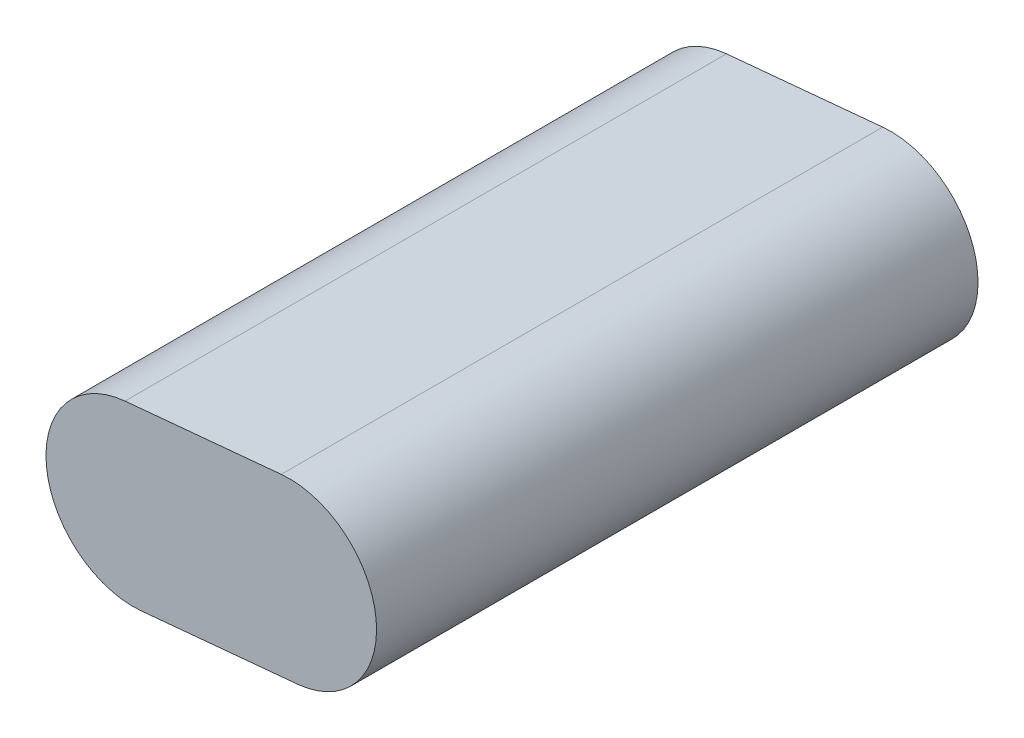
ISO-10303-21;
HEADER;
FILE_DESCRIPTION(('STEP AP214'),'2;1');
FILE_NAME('part.step','',(''),(''),'','','');
FILE_SCHEMA(('AUTOMOTIVE_DESIGN { 1 0 10303 214 1 1 1 1 }'));
ENDSEC;
DATA;
#1=APPLICATION_CONTEXT('core data for automotive mechanical design processes');
#2=APPLICATION_PROTOCOL_DEFINITION('international standard','automotive_design',2000,#1);
#3=PRODUCT_CONTEXT('',#1,'mechanical');
#4=PRODUCT('Part','Part','',(#3));
#5=PRODUCT_RELATED_PRODUCT_CATEGORY('part','',(#4));
#6=PRODUCT_DEFINITION_FORMATION('','',#4);
#7=PRODUCT_DEFINITION_CONTEXT('part definition',#1,'design');
#8=PRODUCT_DEFINITION('design','',#6,#7);
#9=PRODUCT_DEFINITION_SHAPE('','',#8);
#10=(LENGTH_UNIT() NAMED_UNIT(*) SI_UNIT(.MILLI.,.METRE.));
#11=(NAMED_UNIT(*) PLANE_ANGLE_UNIT() SI_UNIT($,.RADIAN.));
#12=(NAMED_UNIT(*) SI_UNIT($,.STERADIAN.) SOLID_ANGLE_UNIT());
#13=UNCERTAINTY_MEASURE_WITH_UNIT(LENGTH_MEASURE(1.E-05),#10,'distance_accuracy_value','');
#14=(GEOMETRIC_REPRESENTATION_CONTEXT(3) GLOBAL_UNCERTAINTY_ASSIGNED_CONTEXT((#13)) GLOBAL_UNIT_ASSIGNED_CONTEXT((#10,
#11,#12)) REPRESENTATION_CONTEXT('',''));
#15=CARTESIAN_POINT('',(0.,0.,0.));
#16=DIRECTION('',(0.,0.,1.));
#17=DIRECTION('',(1.,0.,0.));
#18=AXIS2_PLACEMENT_3D('',#15,#16,#17);
#19=CARTESIAN_POINT('',(0.933851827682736,-9.95630055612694,-108.68170064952));
#20=DIRECTION('',(0.0933851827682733,-0.995630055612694,0.));
#21=DIRECTION('',(0.995630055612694,0.0933851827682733,0.));
#22=AXIS2_PLACEMENT_3D('',#19,#20,#21);
#23=PLANE('',#22);
#24=DIRECTION('',(0.,0.,1.));
#25=VECTOR('',#24,1.);
#26=CARTESIAN_POINT('',(0.933851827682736,-9.95630055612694,-108.68170064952));
#27=LINE('',#26,#25);
#28=CARTESIAN_POINT('',(0.93385182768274,-9.95630055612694,-67.));
#29=VERTEX_POINT('',#28);
#30=CARTESIAN_POINT('',(0.933851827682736,-9.95630055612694,2.));
#31=VERTEX_POINT('',#30);
#32=EDGE_CURVE('E117',#29,#31,#27,.T.);
#33=ORIENTED_EDGE('',*,*,#32,.F.);
#34=DIRECTION('',(-0.995630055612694,-0.0933851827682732,0.));
#35=VECTOR('',#34,1.);
#36=CARTESIAN_POINT('',(18.8551928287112,-8.27536726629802,-67.));
#37=LINE('',#36,#35);
#38=CARTESIAN_POINT('',(18.8551928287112,-8.27536726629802,-67.));
#39=VERTEX_POINT('',#38);
#40=EDGE_CURVE('E146',#39,#29,#37,.T.);
#41=ORIENTED_EDGE('',*,*,#40,.F.);
#42=DIRECTION('',(0.,0.,1.));
#43=VECTOR('',#42,1.);
#44=CARTESIAN_POINT('',(18.8551928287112,-8.27536726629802,-108.68170064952));
#45=LINE('',#44,#43);
#46=CARTESIAN_POINT('',(18.8551928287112,-8.27536726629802,2.));
#47=VERTEX_POINT('',#46);
#48=EDGE_CURVE('E126',#39,#47,#45,.T.);
#49=ORIENTED_EDGE('',*,*,#48,.T.);
#50=DIRECTION('',(0.995630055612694,0.0933851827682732,0.));
#51=VECTOR('',#50,1.);
#52=CARTESIAN_POINT('',(0.933851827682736,-9.95630055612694,2.));
#53=LINE('',#52,#51);
#54=EDGE_CURVE('E129',#31,#47,#53,.T.);
#55=ORIENTED_EDGE('',*,*,#54,.F.);
#56=EDGE_LOOP('',(#33,#41,#49,#55));
#57=FACE_BOUND('',#56,.T.);
#58=ADVANCED_FACE('F50',(#57),#23,.T.);
#59=CARTESIAN_POINT('',(17.9213410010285,1.68093328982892,-108.68170064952));
#60=DIRECTION('',(0.,0.,1.));
#61=DIRECTION('',(1.,0.,0.));
#62=AXIS2_PLACEMENT_3D('',#59,#60,#61);
#63=CYLINDRICAL_SURFACE('',#62,10.);
#64=ORIENTED_EDGE('',*,*,#48,.F.);
#65=CARTESIAN_POINT('',(17.9213410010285,1.68093328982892,-67.));
#66=DIRECTION('',(0.,0.,-1.));
#67=DIRECTION('',(-1.,0.,0.));
#68=AXIS2_PLACEMENT_3D('',#65,#66,#67);
#69=CIRCLE('',#68,10.);
#70=CARTESIAN_POINT('',(16.9874891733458,11.6372338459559,-67.));
#71=VERTEX_POINT('',#70);
#72=EDGE_CURVE('E143',#71,#39,#69,.T.);
#73=ORIENTED_EDGE('',*,*,#72,.F.);
#74=DIRECTION('',(0.,0.,1.));
#75=VECTOR('',#74,1.);
#76=CARTESIAN_POINT('',(16.9874891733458,11.6372338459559,-108.68170064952));
#77=LINE('',#76,#75);
#78=CARTESIAN_POINT('',(16.9874891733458,11.6372338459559,2.));
#79=VERTEX_POINT('',#78);
#80=EDGE_CURVE('E178',#71,#79,#77,.T.);
#81=ORIENTED_EDGE('',*,*,#80,.T.);
#82=CARTESIAN_POINT('',(17.9213410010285,1.68093328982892,2.));
#83=DIRECTION('',(0.,0.,1.));
#84=DIRECTION('',(1.,0.,0.));
#85=AXIS2_PLACEMENT_3D('',#82,#83,#84);
#86=CIRCLE('',#85,10.);
#87=EDGE_CURVE('E133',#47,#79,#86,.T.);
#88=ORIENTED_EDGE('',*,*,#87,.F.);
#89=EDGE_LOOP('',(#64,#73,#81,#88));
#90=FACE_BOUND('',#89,.T.);
#91=ADVANCED_FACE('F182',(#90),#63,.T.);
#92=CARTESIAN_POINT('',(-0.933851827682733,9.95630055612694,-108.68170064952));
#93=DIRECTION('',(-0.0933851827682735,0.995630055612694,0.));
#94=DIRECTION('',(-0.995630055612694,-0.0933851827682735,0.));
#95=AXIS2_PLACEMENT_3D('',#92,#93,#94);
#96=PLANE('',#95);
#97=ORIENTED_EDGE('',*,*,#80,.F.);
#98=DIRECTION('',(0.995630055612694,0.0933851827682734,0.));
#99=VECTOR('',#98,1.);
#100=CARTESIAN_POINT('',(-0.933851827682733,9.95630055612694,-67.));
#101=LINE('',#100,#99);
#102=CARTESIAN_POINT('',(-0.933851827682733,9.95630055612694,-67.));
#103=VERTEX_POINT('',#102);
#104=EDGE_CURVE('E149',#103,#71,#101,.T.);
#105=ORIENTED_EDGE('',*,*,#104,.F.);
#106=DIRECTION('',(0.,0.,1.));
#107=VECTOR('',#106,1.);
#108=CARTESIAN_POINT('',(-0.933851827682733,9.95630055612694,-108.68170064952));
#109=LINE('',#108,#107);
#110=CARTESIAN_POINT('',(-0.933851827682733,9.95630055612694,2.));
#111=VERTEX_POINT('',#110);
#112=EDGE_CURVE('E176',#103,#111,#109,.T.);
#113=ORIENTED_EDGE('',*,*,#112,.T.);
#114=DIRECTION('',(-0.995630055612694,-0.0933851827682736,0.));
#115=VECTOR('',#114,1.);
#116=CARTESIAN_POINT('',(16.9874891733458,11.6372338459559,2.));
#117=LINE('',#116,#115);
#118=EDGE_CURVE('E138',#79,#111,#117,.T.);
#119=ORIENTED_EDGE('',*,*,#118,.F.);
#120=EDGE_LOOP('',(#97,#105,#113,#119));
#121=FACE_BOUND('',#120,.T.);
#122=ADVANCED_FACE('F185',(#121),#96,.T.);
#123=CARTESIAN_POINT('',(0.,0.,-108.68170064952));
#124=DIRECTION('',(0.,0.,1.));
#125=DIRECTION('',(1.,0.,0.));
#126=AXIS2_PLACEMENT_3D('',#123,#124,#125);
#127=CYLINDRICAL_SURFACE('',#126,10.);
#128=ORIENTED_EDGE('',*,*,#112,.F.);
#129=CARTESIAN_POINT('',(0.,0.,-67.));
#130=DIRECTION('',(0.,0.,-1.));
#131=DIRECTION('',(-1.,0.,0.));
#132=AXIS2_PLACEMENT_3D('',#129,#130,#131);
#133=CIRCLE('',#132,10.);
#134=EDGE_CURVE('E122',#29,#103,#133,.T.);
#135=ORIENTED_EDGE('',*,*,#134,.F.);
#136=ORIENTED_EDGE('',*,*,#32,.T.);
#137=CARTESIAN_POINT('',(0.,0.,2.));
#138=DIRECTION('',(0.,0.,1.));
#139=DIRECTION('',(1.,0.,0.));
#140=AXIS2_PLACEMENT_3D('',#137,#138,#139);
#141=CIRCLE('',#140,10.);
#142=EDGE_CURVE('E120',#111,#31,#141,.T.);
#143=ORIENTED_EDGE('',*,*,#142,.F.);
#144=EDGE_LOOP('',(#128,#135,#136,#143));
#145=FACE_BOUND('',#144,.T.);
#146=ADVANCED_FACE('F52',(#145),#127,.T.);
#147=CARTESIAN_POINT('',(17.9213410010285,1.68093328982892,-67.));
#148=DIRECTION('',(0.,0.,-1.));
#149=DIRECTION('',(-1.,0.,0.));
#150=AXIS2_PLACEMENT_3D('',#147,#148,#149);
#151=PLANE('',#150);
#152=ORIENTED_EDGE('',*,*,#72,.T.);
#153=ORIENTED_EDGE('',*,*,#40,.T.);
#154=ORIENTED_EDGE('',*,*,#134,.T.);
#155=ORIENTED_EDGE('',*,*,#104,.T.);
#156=EDGE_LOOP('',(#152,#153,#154,#155));
#157=FACE_BOUND('',#156,.T.);
#158=ADVANCED_FACE('F187',(#157),#151,.T.);
#159=CARTESIAN_POINT('',(0.,0.,2.));
#160=DIRECTION('',(0.,0.,1.));
#161=DIRECTION('',(1.,0.,0.));
#162=AXIS2_PLACEMENT_3D('',#159,#160,#161);
#163=PLANE('',#162);
#164=ORIENTED_EDGE('',*,*,#142,.T.);
#165=ORIENTED_EDGE('',*,*,#54,.T.);
#166=ORIENTED_EDGE('',*,*,#87,.T.);
#167=ORIENTED_EDGE('',*,*,#118,.T.);
#168=EDGE_LOOP('',(#164,#165,#166,#167));
#169=FACE_BOUND('',#168,.T.);
#170=ADVANCED_FACE('F136',(#169),#163,.T.);
#171=CLOSED_SHELL('',(#58,#91,#122,#146,#158,#170));
#172=CARTESIAN_POINT('',(17.9213410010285,1.68093328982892,-65.));
#173=DIRECTION('',(0.,0.,-1.));
#174=DIRECTION('',(-1.,0.,0.));
#175=AXIS2_PLACEMENT_3D('',#172,#173,#174);
#176=PLANE('',#175);
#177=DIRECTION('',(-0.995630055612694,-0.0933851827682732,0.));
#178=VECTOR('',#177,1.);
#179=CARTESIAN_POINT('',(0.84046664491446,-8.96067050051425,-65.));
#180=LINE('',#179,#178);
#181=CARTESIAN_POINT('',(18.761807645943,-7.27973721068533,-65.));
#182=VERTEX_POINT('',#181);
#183=CARTESIAN_POINT('',(0.84046664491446,-8.96067050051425,-65.));
#184=VERTEX_POINT('',#183);
#185=EDGE_CURVE('E54',#182,#184,#180,.T.);
#186=ORIENTED_EDGE('',*,*,#185,.F.);
#187=CARTESIAN_POINT('',(17.9213410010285,1.68093328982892,-65.));
#188=DIRECTION('',(0.,0.,1.));
#189=DIRECTION('',(1.,0.,0.));
#190=AXIS2_PLACEMENT_3D('',#187,#188,#189);
#191=CIRCLE('',#190,9.);
#192=CARTESIAN_POINT('',(17.080874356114,10.6416037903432,-65.));
#193=VERTEX_POINT('',#192);
#194=EDGE_CURVE('E13',#193,#182,#191,.F.);
#195=ORIENTED_EDGE('',*,*,#194,.F.);
#196=DIRECTION('',(0.995630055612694,0.0933851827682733,0.));
#197=VECTOR('',#196,1.);
#198=CARTESIAN_POINT('',(-0.84046664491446,8.96067050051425,-65.));
#199=LINE('',#198,#197);
#200=CARTESIAN_POINT('',(-0.84046664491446,8.96067050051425,-65.));
#201=VERTEX_POINT('',#200);
#202=EDGE_CURVE('E60',#201,#193,#199,.T.);
#203=ORIENTED_EDGE('',*,*,#202,.F.);
#204=CARTESIAN_POINT('',(0.,0.,-65.));
#205=DIRECTION('',(0.,0.,1.));
#206=DIRECTION('',(1.,0.,0.));
#207=AXIS2_PLACEMENT_3D('',#204,#205,#206);
#208=CIRCLE('',#207,9.);
#209=EDGE_CURVE('E154',#184,#201,#208,.F.);
#210=ORIENTED_EDGE('',*,*,#209,.F.);
#211=EDGE_LOOP('',(#186,#195,#203,#210));
#212=FACE_BOUND('',#211,.T.);
#213=ADVANCED_FACE('F216',(#212),#176,.F.);
#214=CARTESIAN_POINT('',(0.84046664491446,-8.96067050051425,-108.68170064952));
#215=DIRECTION('',(0.0933851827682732,-0.995630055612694,0.));
#216=DIRECTION('',(0.995630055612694,0.0933851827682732,0.));
#217=AXIS2_PLACEMENT_3D('',#214,#215,#216);
#218=PLANE('',#217);
#219=DIRECTION('',(0.,0.,1.));
#220=VECTOR('',#219,1.);
#221=CARTESIAN_POINT('',(18.761807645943,-7.27973721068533,-108.68170064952));
#222=LINE('',#221,#220);
#223=CARTESIAN_POINT('',(18.761807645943,-7.27973721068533,0.));
#224=VERTEX_POINT('',#223);
#225=EDGE_CURVE('E172',#182,#224,#222,.T.);
#226=ORIENTED_EDGE('',*,*,#225,.F.);
#227=ORIENTED_EDGE('',*,*,#185,.T.);
#228=DIRECTION('',(0.,0.,1.));
#229=VECTOR('',#228,1.);
#230=CARTESIAN_POINT('',(0.84046664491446,-8.96067050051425,-108.68170064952));
#231=LINE('',#230,#229);
#232=CARTESIAN_POINT('',(0.84046664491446,-8.96067050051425,0.));
#233=VERTEX_POINT('',#232);
#234=EDGE_CURVE('E166',#184,#233,#231,.T.);
#235=ORIENTED_EDGE('',*,*,#234,.T.);
#236=DIRECTION('',(0.995630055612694,0.0933851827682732,0.));
#237=VECTOR('',#236,1.);
#238=CARTESIAN_POINT('',(0.84046664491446,-8.96067050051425,0.));
#239=LINE('',#238,#237);
#240=EDGE_CURVE('E159',#233,#224,#239,.T.);
#241=ORIENTED_EDGE('',*,*,#240,.T.);
#242=EDGE_LOOP('',(#226,#227,#235,#241));
#243=FACE_BOUND('',#242,.T.);
#244=ADVANCED_FACE('F212',(#243),#218,.F.);
#245=CARTESIAN_POINT('',(17.9213410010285,1.68093328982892,-108.68170064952));
#246=DIRECTION('',(0.,0.,1.));
#247=DIRECTION('',(1.,0.,0.));
#248=AXIS2_PLACEMENT_3D('',#245,#246,#247);
#249=CYLINDRICAL_SURFACE('',#248,9.);
#250=DIRECTION('',(0.,0.,1.));
#251=VECTOR('',#250,1.);
#252=CARTESIAN_POINT('',(17.080874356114,10.6416037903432,-108.68170064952));
#253=LINE('',#252,#251);
#254=CARTESIAN_POINT('',(17.080874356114,10.6416037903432,0.));
#255=VERTEX_POINT('',#254);
#256=EDGE_CURVE('E169',#193,#255,#253,.T.);
#257=ORIENTED_EDGE('',*,*,#256,.F.);
#258=ORIENTED_EDGE('',*,*,#194,.T.);
#259=ORIENTED_EDGE('',*,*,#225,.T.);
#260=CARTESIAN_POINT('',(17.9213410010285,1.68093328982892,0.));
#261=DIRECTION('',(0.,0.,1.));
#262=DIRECTION('',(1.,0.,0.));
#263=AXIS2_PLACEMENT_3D('',#260,#261,#262);
#264=CIRCLE('',#263,9.);
#265=EDGE_CURVE('E75',#224,#255,#264,.T.);
#266=ORIENTED_EDGE('',*,*,#265,.T.);
#267=EDGE_LOOP('',(#257,#258,#259,#266));
#268=FACE_BOUND('',#267,.T.);
#269=ADVANCED_FACE('F215',(#268),#249,.F.);
#270=CARTESIAN_POINT('',(-0.84046664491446,8.96067050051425,-108.68170064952));
#271=DIRECTION('',(-0.0933851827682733,0.995630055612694,0.));
#272=DIRECTION('',(-0.995630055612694,-0.0933851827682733,0.));
#273=AXIS2_PLACEMENT_3D('',#270,#271,#272);
#274=PLANE('',#273);
#275=DIRECTION('',(0.,0.,1.));
#276=VECTOR('',#275,1.);
#277=CARTESIAN_POINT('',(-0.84046664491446,8.96067050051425,-108.68170064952));
#278=LINE('',#277,#276);
#279=CARTESIAN_POINT('',(-0.84046664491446,8.96067050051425,0.));
#280=VERTEX_POINT('',#279);
#281=EDGE_CURVE('E127',#201,#280,#278,.T.);
#282=ORIENTED_EDGE('',*,*,#281,.F.);
#283=ORIENTED_EDGE('',*,*,#202,.T.);
#284=ORIENTED_EDGE('',*,*,#256,.T.);
#285=DIRECTION('',(-0.995630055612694,-0.0933851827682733,0.));
#286=VECTOR('',#285,1.);
#287=CARTESIAN_POINT('',(-0.84046664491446,8.96067050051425,0.));
#288=LINE('',#287,#286);
#289=EDGE_CURVE('E163',#255,#280,#288,.T.);
#290=ORIENTED_EDGE('',*,*,#289,.T.);
#291=EDGE_LOOP('',(#282,#283,#284,#290));
#292=FACE_BOUND('',#291,.T.);
#293=ADVANCED_FACE('F209',(#292),#274,.F.);
#294=CARTESIAN_POINT('',(0.,0.,-108.68170064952));
#295=DIRECTION('',(0.,0.,1.));
#296=DIRECTION('',(1.,0.,0.));
#297=AXIS2_PLACEMENT_3D('',#294,#295,#296);
#298=CYLINDRICAL_SURFACE('',#297,9.);
#299=ORIENTED_EDGE('',*,*,#234,.F.);
#300=ORIENTED_EDGE('',*,*,#209,.T.);
#301=ORIENTED_EDGE('',*,*,#281,.T.);
#302=CARTESIAN_POINT('',(0.,0.,0.));
#303=DIRECTION('',(0.,0.,1.));
#304=DIRECTION('',(1.,0.,0.));
#305=AXIS2_PLACEMENT_3D('',#302,#303,#304);
#306=CIRCLE('',#305,9.);
#307=EDGE_CURVE('E151',#280,#233,#306,.T.);
#308=ORIENTED_EDGE('',*,*,#307,.T.);
#309=EDGE_LOOP('',(#299,#300,#301,#308));
#310=FACE_BOUND('',#309,.T.);
#311=ADVANCED_FACE('F205',(#310),#298,.F.);
#312=CARTESIAN_POINT('',(0.,0.,0.));
#313=DIRECTION('',(0.,0.,1.));
#314=DIRECTION('',(1.,0.,0.));
#315=AXIS2_PLACEMENT_3D('',#312,#313,#314);
#316=PLANE('',#315);
#317=ORIENTED_EDGE('',*,*,#307,.F.);
#318=ORIENTED_EDGE('',*,*,#289,.F.);
#319=ORIENTED_EDGE('',*,*,#265,.F.);
#320=ORIENTED_EDGE('',*,*,#240,.F.);
#321=EDGE_LOOP('',(#317,#318,#319,#320));
#322=FACE_BOUND('',#321,.T.);
#323=ADVANCED_FACE('F208',(#322),#316,.F.);
#324=CLOSED_SHELL('',(#213,#244,#269,#293,#311,#323));
#325=ORIENTED_CLOSED_SHELL('',*,#324,.T.);
#326=BREP_WITH_VOIDS('B2',#171,(#325));
#327=ADVANCED_BREP_SHAPE_REPRESENTATION('',(#18,#326),#14);
#328=SHAPE_DEFINITION_REPRESENTATION(#9,#327);
ENDSEC;
END-ISO-10303-21;
